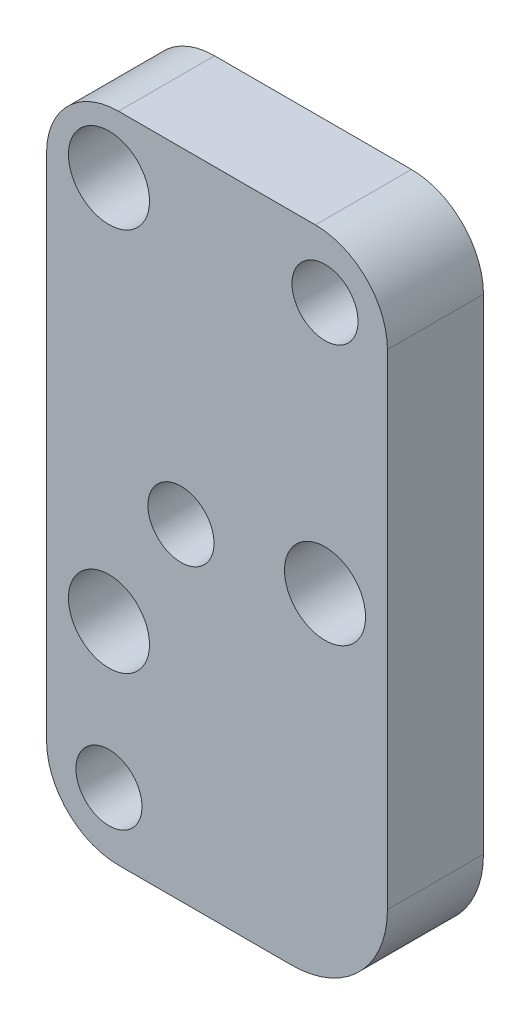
from build123d import *

# Parameters (mm, degrees)
BOSS_EXTRUDE1_DEPTH = 12.7
HOLE12_D            = 7.1374
HOLE12_CBORE_D      = 10.7188
HOLE12_CBORE_DEPTH  = 7.874
HOLE1_D             = 8.7376


with BuildPart() as part:
    # Sketch1 → Boss-Extrude1 (new body)
    with BuildSketch(Plane(origin=(0, 0, 71.9582), x_dir=(-1, 0, 0), z_dir=(0, 0, -1))):
        with BuildLine():
            Line((147.955, 87.3252), (121.92, 87.3252))
            ThreePointArc((121.92, 87.3252), (115.184807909, 84.535392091), (112.395, 77.8002))
            Line((112.395, 77.8002), (112.395, 13.6652))
            ThreePointArc((112.395, 13.6652), (116.114743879, 4.684943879), (125.095, 0.9652))
            Line((125.095, 0.9652), (147.955, 0.9652))
            ThreePointArc((147.955, 0.9652), (154.690192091, 3.755007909), (157.48, 10.4902))
            Line((157.48, 10.4902), (157.48, 77.8002))
            ThreePointArc((157.48, 77.8002), (154.690192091, 84.535392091), (147.955, 87.3252))
        make_face()
    extrude(amount=-BOSS_EXTRUDE1_DEPTH)

    # Hole12 (through all)
    with Locations(Plane(origin=(-139.234107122, 54.351199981, 84.6582), x_dir=(1, 0, 0), z_dir=(0, 0, 1))):
        with Locations((-9.990892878, -26.080999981), (18.584107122, -8.618499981), (-9.990892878, 24.719000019)):
            CounterBoreHole(HOLE12_D / 2, HOLE12_CBORE_D / 2, HOLE12_CBORE_DEPTH)

    # Hole1 (through all)
    with Locations(Plane(origin=(-116.995739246, 89.671340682, 71.9582), x_dir=(-1, 0, 0), z_dir=(0, 0, -1))):
        with Locations((3.654260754, -10.601140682), (22.704260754, -45.526140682), (32.229260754, -80.451140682)):
            Hole(HOLE1_D / 2)


solid = part.part
